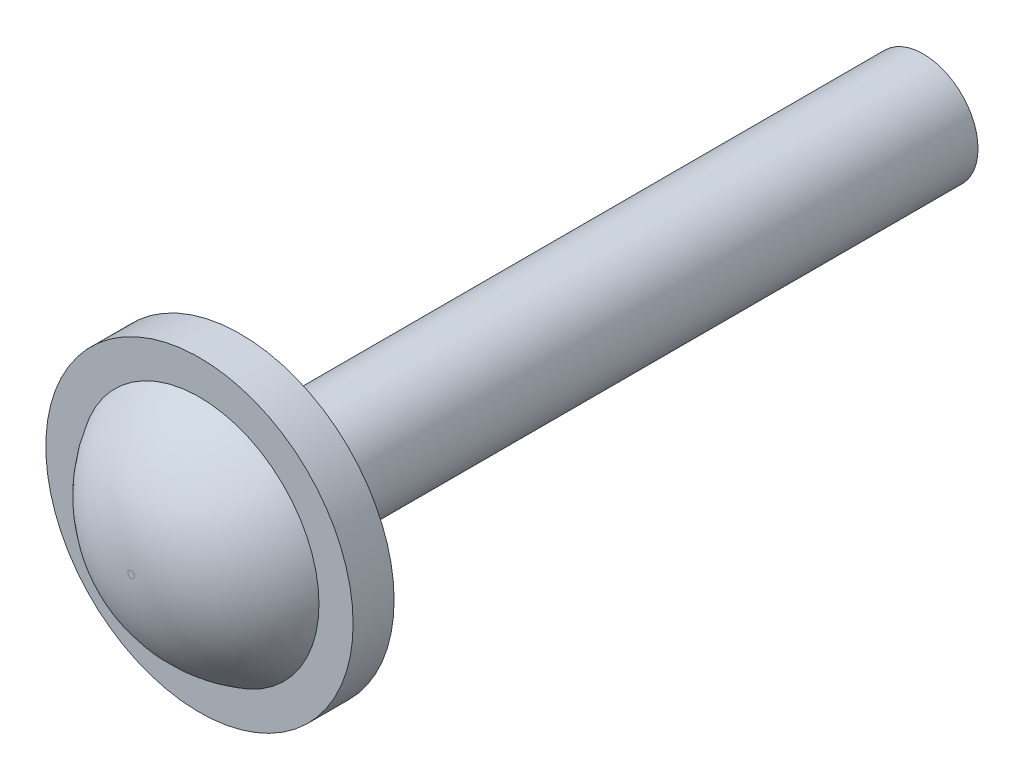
ISO-10303-21;
HEADER;
FILE_DESCRIPTION(('STEP AP214'),'2;1');
FILE_NAME('part.step','',(''),(''),'','','');
FILE_SCHEMA(('AUTOMOTIVE_DESIGN { 1 0 10303 214 1 1 1 1 }'));
ENDSEC;
DATA;
#1=APPLICATION_CONTEXT('core data for automotive mechanical design processes');
#2=APPLICATION_PROTOCOL_DEFINITION('international standard','automotive_design',2000,#1);
#3=PRODUCT_CONTEXT('',#1,'mechanical');
#4=PRODUCT('Part','Part','',(#3));
#5=PRODUCT_RELATED_PRODUCT_CATEGORY('part','',(#4));
#6=PRODUCT_DEFINITION_FORMATION('','',#4);
#7=PRODUCT_DEFINITION_CONTEXT('part definition',#1,'design');
#8=PRODUCT_DEFINITION('design','',#6,#7);
#9=PRODUCT_DEFINITION_SHAPE('','',#8);
#10=(LENGTH_UNIT() NAMED_UNIT(*) SI_UNIT(.MILLI.,.METRE.));
#11=(NAMED_UNIT(*) PLANE_ANGLE_UNIT() SI_UNIT($,.RADIAN.));
#12=(NAMED_UNIT(*) SI_UNIT($,.STERADIAN.) SOLID_ANGLE_UNIT());
#13=UNCERTAINTY_MEASURE_WITH_UNIT(LENGTH_MEASURE(1.E-05),#10,'distance_accuracy_value','');
#14=(GEOMETRIC_REPRESENTATION_CONTEXT(3) GLOBAL_UNCERTAINTY_ASSIGNED_CONTEXT((#13)) GLOBAL_UNIT_ASSIGNED_CONTEXT((#10,
#11,#12)) REPRESENTATION_CONTEXT('',''));
#15=CARTESIAN_POINT('',(0.,0.,0.));
#16=DIRECTION('',(0.,0.,1.));
#17=DIRECTION('',(1.,0.,0.));
#18=AXIS2_PLACEMENT_3D('',#15,#16,#17);
#19=CARTESIAN_POINT('',(0.,0.05,1.6));
#20=DIRECTION('',(0.,0.,-1.));
#21=DIRECTION('',(-1.,0.,0.));
#22=AXIS2_PLACEMENT_3D('',#19,#20,#21);
#23=PLANE('',#22);
#24=CARTESIAN_POINT('',(0.,0.,1.6));
#25=DIRECTION('',(0.,0.,1.));
#26=DIRECTION('',(1.,0.,0.));
#27=AXIS2_PLACEMENT_3D('',#24,#25,#26);
#28=CIRCLE('',#27,0.0500000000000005);
#29=CARTESIAN_POINT('',(0.0500000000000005,0.,1.6));
#30=VERTEX_POINT('',#29);
#31=EDGE_CURVE('E10',#30,#30,#28,.T.);
#32=ORIENTED_EDGE('',*,*,#31,.T.);
#33=EDGE_LOOP('',(#32));
#34=FACE_BOUND('',#33,.T.);
#35=ADVANCED_FACE('F716',(#34),#23,.F.);
#36=CARTESIAN_POINT('',(0.,0.,-0.344999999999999));
#37=DIRECTION('',(0.,0.,1.));
#38=DIRECTION('',(1.,0.,0.));
#39=AXIS2_PLACEMENT_3D('',#36,#37,#38);
#40=DEGENERATE_TOROIDAL_SURFACE('',#39,0.0500000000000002,1.945,.T.);
#41=ORIENTED_EDGE('',*,*,#31,.F.);
#42=EDGE_LOOP('',(#41));
#43=FACE_BOUND('',#42,.T.);
#44=CARTESIAN_POINT('',(0.,0.,0.6));
#45=DIRECTION('',(0.,0.,1.));
#46=DIRECTION('',(1.,0.,0.));
#47=AXIS2_PLACEMENT_3D('',#44,#45,#46);
#48=CIRCLE('',#47,1.75);
#49=CARTESIAN_POINT('',(1.75,0.,0.6));
#50=VERTEX_POINT('',#49);
#51=EDGE_CURVE('E722',#50,#50,#48,.T.);
#52=ORIENTED_EDGE('',*,*,#51,.T.);
#53=EDGE_LOOP('',(#52));
#54=FACE_BOUND('',#53,.T.);
#55=ADVANCED_FACE('F757',(#43,#54),#40,.T.);
#56=CARTESIAN_POINT('',(0.,1.75,0.6));
#57=DIRECTION('',(0.,0.,-1.));
#58=DIRECTION('',(-1.,0.,0.));
#59=AXIS2_PLACEMENT_3D('',#56,#57,#58);
#60=PLANE('',#59);
#61=ORIENTED_EDGE('',*,*,#51,.F.);
#62=EDGE_LOOP('',(#61));
#63=FACE_BOUND('',#62,.T.);
#64=CARTESIAN_POINT('',(0.,0.,0.6));
#65=DIRECTION('',(0.,0.,1.));
#66=DIRECTION('',(1.,0.,0.));
#67=AXIS2_PLACEMENT_3D('',#64,#65,#66);
#68=CIRCLE('',#67,2.25);
#69=CARTESIAN_POINT('',(2.25,0.,0.6));
#70=VERTEX_POINT('',#69);
#71=EDGE_CURVE('E726',#70,#70,#68,.T.);
#72=ORIENTED_EDGE('',*,*,#71,.T.);
#73=EDGE_LOOP('',(#72));
#74=FACE_BOUND('',#73,.T.);
#75=ADVANCED_FACE('F761',(#63,#74),#60,.F.);
#76=CARTESIAN_POINT('',(0.,0.,0.));
#77=DIRECTION('',(0.,0.,1.));
#78=DIRECTION('',(1.,0.,0.));
#79=AXIS2_PLACEMENT_3D('',#76,#77,#78);
#80=CYLINDRICAL_SURFACE('',#79,2.25);
#81=ORIENTED_EDGE('',*,*,#71,.F.);
#82=EDGE_LOOP('',(#81));
#83=FACE_BOUND('',#82,.T.);
#84=CARTESIAN_POINT('',(0.,0.,0.));
#85=DIRECTION('',(0.,0.,1.));
#86=DIRECTION('',(1.,0.,0.));
#87=AXIS2_PLACEMENT_3D('',#84,#85,#86);
#88=CIRCLE('',#87,2.25);
#89=CARTESIAN_POINT('',(2.25,0.,0.));
#90=VERTEX_POINT('',#89);
#91=EDGE_CURVE('E730',#90,#90,#88,.T.);
#92=ORIENTED_EDGE('',*,*,#91,.T.);
#93=EDGE_LOOP('',(#92));
#94=FACE_BOUND('',#93,.T.);
#95=ADVANCED_FACE('F766',(#83,#94),#80,.T.);
#96=CARTESIAN_POINT('',(0.,1.8,0.));
#97=DIRECTION('',(0.,0.,1.));
#98=DIRECTION('',(1.,0.,0.));
#99=AXIS2_PLACEMENT_3D('',#96,#97,#98);
#100=PLANE('',#99);
#101=ORIENTED_EDGE('',*,*,#91,.F.);
#102=EDGE_LOOP('',(#101));
#103=FACE_BOUND('',#102,.T.);
#104=CARTESIAN_POINT('',(0.,0.,0.));
#105=DIRECTION('',(0.,0.,1.));
#106=DIRECTION('',(1.,0.,0.));
#107=AXIS2_PLACEMENT_3D('',#104,#105,#106);
#108=CIRCLE('',#107,1.8);
#109=CARTESIAN_POINT('',(1.8,0.,0.));
#110=VERTEX_POINT('',#109);
#111=EDGE_CURVE('E735',#110,#110,#108,.T.);
#112=ORIENTED_EDGE('',*,*,#111,.T.);
#113=EDGE_LOOP('',(#112));
#114=FACE_BOUND('',#113,.T.);
#115=ADVANCED_FACE('F772',(#103,#114),#100,.F.);
#116=CARTESIAN_POINT('',(0.,0.,-1.));
#117=DIRECTION('',(0.,0.,1.));
#118=DIRECTION('',(1.,0.,0.));
#119=AXIS2_PLACEMENT_3D('',#116,#117,#118);
#120=TOROIDAL_SURFACE('',#119,1.79999999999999,1.);
#121=ORIENTED_EDGE('',*,*,#111,.F.);
#122=EDGE_LOOP('',(#121));
#123=FACE_BOUND('',#122,.T.);
#124=CARTESIAN_POINT('',(0.,0.,-1.00000000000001));
#125=DIRECTION('',(0.,0.,1.));
#126=DIRECTION('',(1.,0.,0.));
#127=AXIS2_PLACEMENT_3D('',#124,#125,#126);
#128=CIRCLE('',#127,0.799999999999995);
#129=CARTESIAN_POINT('',(0.799999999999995,0.,-1.00000000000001));
#130=VERTEX_POINT('',#129);
#131=EDGE_CURVE('E738',#130,#130,#128,.T.);
#132=ORIENTED_EDGE('',*,*,#131,.T.);
#133=EDGE_LOOP('',(#132));
#134=FACE_BOUND('',#133,.T.);
#135=ADVANCED_FACE('F753',(#123,#134),#120,.F.);
#136=CARTESIAN_POINT('',(0.,0.,0.));
#137=DIRECTION('',(0.,0.,1.));
#138=DIRECTION('',(1.,0.,0.));
#139=AXIS2_PLACEMENT_3D('',#136,#137,#138);
#140=CYLINDRICAL_SURFACE('',#139,0.799999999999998);
#141=ORIENTED_EDGE('',*,*,#131,.F.);
#142=EDGE_LOOP('',(#141));
#143=FACE_BOUND('',#142,.T.);
#144=CARTESIAN_POINT('',(0.,0.,-10.));
#145=DIRECTION('',(0.,0.,1.));
#146=DIRECTION('',(1.,0.,0.));
#147=AXIS2_PLACEMENT_3D('',#144,#145,#146);
#148=CIRCLE('',#147,0.799999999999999);
#149=CARTESIAN_POINT('',(0.799999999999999,0.,-10.));
#150=VERTEX_POINT('',#149);
#151=EDGE_CURVE('E741',#150,#150,#148,.T.);
#152=ORIENTED_EDGE('',*,*,#151,.T.);
#153=EDGE_LOOP('',(#152));
#154=FACE_BOUND('',#153,.T.);
#155=ADVANCED_FACE('F745',(#143,#154),#140,.T.);
#156=CARTESIAN_POINT('',(0.,0.,-10.));
#157=DIRECTION('',(0.,0.,1.));
#158=DIRECTION('',(1.,0.,0.));
#159=AXIS2_PLACEMENT_3D('',#156,#157,#158);
#160=PLANE('',#159);
#161=ORIENTED_EDGE('',*,*,#151,.F.);
#162=EDGE_LOOP('',(#161));
#163=FACE_BOUND('',#162,.T.);
#164=ADVANCED_FACE('F747',(#163),#160,.F.);
#165=CLOSED_SHELL('',(#35,#55,#75,#95,#115,#135,#155,#164));
#166=MANIFOLD_SOLID_BREP('B2',#165);
#167=ADVANCED_BREP_SHAPE_REPRESENTATION('',(#18,#166),#14);
#168=SHAPE_DEFINITION_REPRESENTATION(#9,#167);
ENDSEC;
END-ISO-10303-21;
